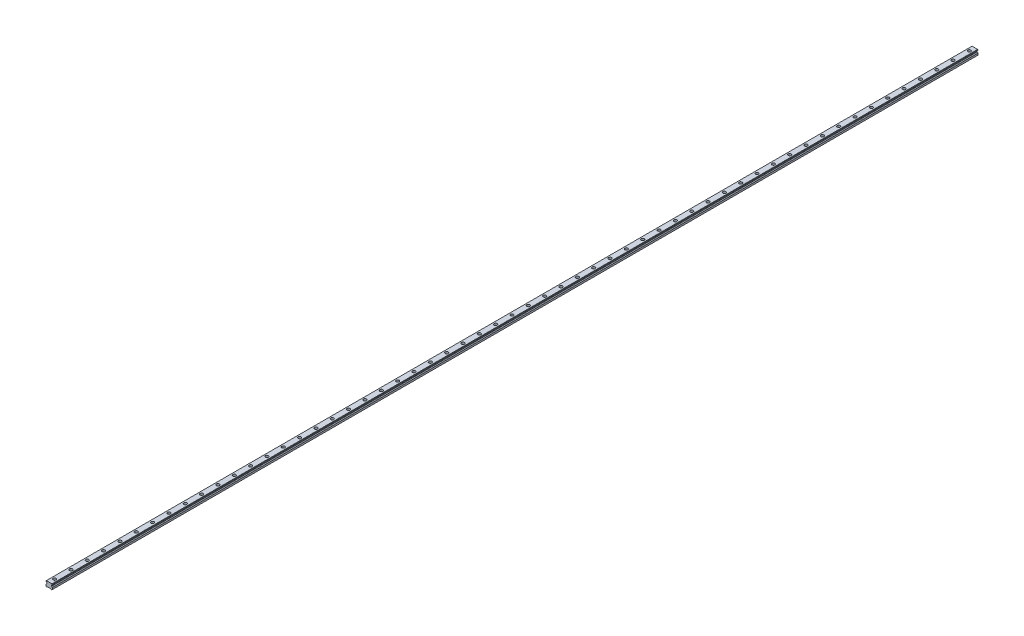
from build123d import *

# Parameters (mm, degrees)
SKETCH1_W           = 23
SKETCH1_H           = 19.2
BOSS_EXTRUDE1_DEPTH = 1700
CUT_EXTRUDE1_DEPTH  = 3401.073659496
CHAMFER1_SIZE       = 1.25
FILLET1_R           = 1.25
CUT_EXTRUDE2_DEPTH  = 3401.073659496
SKETCH4_R           = 5.5
SKETCH4_R_2         = 3.5
CUT_EXTRUDE3_DEPTH  = 9
SKETCH4_2_R         = 3.5
CUT_EXTRUDE4_DEPTH  = 1701.147314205
LPATTERN1_COUNT     = 57
LPATTERN1_PITCH     = 60


with BuildPart() as part:
    # Sketch1 → Boss-Extrude1 (new, symmetric)
    with BuildSketch(Plane.XY):
        with Locations((0, 9.6)):
            Rectangle(SKETCH1_W, SKETCH1_H)
    extrude(amount=BOSS_EXTRUDE1_DEPTH, both=True)

    # Sketch2 → Cut-Extrude1 (cut, through all)
    with BuildSketch(Plane.XY.offset(1700)):
        Polygon((-11.5, 16.7), (-11.5, 7.95), (-8.583333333, 10.866666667), (-8.583333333, 13.783333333), align=None)
        Polygon((8.583333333, 13.783333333), (11.5, 16.7), (11.5, 7.95), (8.583333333, 10.866666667), align=None)
    extrude(amount=-CUT_EXTRUDE1_DEPTH, mode=Mode.SUBTRACT)

    # Chamfer1
    chamfer1_edges = [part.edges().sort_by_distance(p)[0] for p in [
        (-11.5, 19.2, 0),
        (11.5, 19.2, 0),
        (11.5, 0, 0),
        (-11.5, 0, 0),
    ]]
    chamfer(chamfer1_edges, length=CHAMFER1_SIZE)

    # Fillet1
    fillet1_edges = [part.edges().sort_by_distance(p)[0] for p in [
        (-8.583333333, 13.783333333, 0),
        (-8.583333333, 10.866666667, 0),
        (8.583333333, 10.866666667, 0),
        (8.583333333, 13.783333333, 0),
    ]]
    fillet(fillet1_edges, radius=FILLET1_R)

    # Sketch3 → Cut-Extrude2 (cut, through all)
    with BuildSketch(Plane.XY.offset(1700)):
        Polygon((-7, 0), (-5.75, 1.25), (5.75, 1.25), (7, 0), align=None)
    extrude(amount=-CUT_EXTRUDE2_DEPTH, mode=Mode.SUBTRACT)

    # Sketch4 → Cut-Extrude3 (cut)
    with BuildSketch(Plane(origin=(0, 19.2, 0), x_dir=(1, 0, 0), z_dir=(0, 1, 0))):
        with Locations(Location((0, -1680, 0), (0, 0, 270))):
            Circle(SKETCH4_R)
        with Locations(Location((0, -1680, 0), (0, 0, 270))):
            Circle(SKETCH4_R_2, mode=Mode.SUBTRACT)
    cut_extrude3 = extrude(amount=-CUT_EXTRUDE3_DEPTH, mode=Mode.SUBTRACT)

    # Sketch4_2 → Cut-Extrude4 (cut, through all)
    with BuildSketch(Plane(origin=(0, 19.2, 0), x_dir=(1, 0, 0), z_dir=(0, 1, 0))):
        with Locations(Location((0, -1680, 0), (0, 0, 270))):
            Circle(SKETCH4_2_R)
    cut_extrude4 = extrude(amount=-CUT_EXTRUDE4_DEPTH, mode=Mode.SUBTRACT)

    # LPattern1: Cut-Extrude3, Cut-Extrude4 ×57
    with Locations(*[(0, 0, -i * LPATTERN1_PITCH) for i in range(1, LPATTERN1_COUNT)]):
        add(cut_extrude3, mode=Mode.SUBTRACT)
        add(cut_extrude4, mode=Mode.SUBTRACT)


solid = part.part
